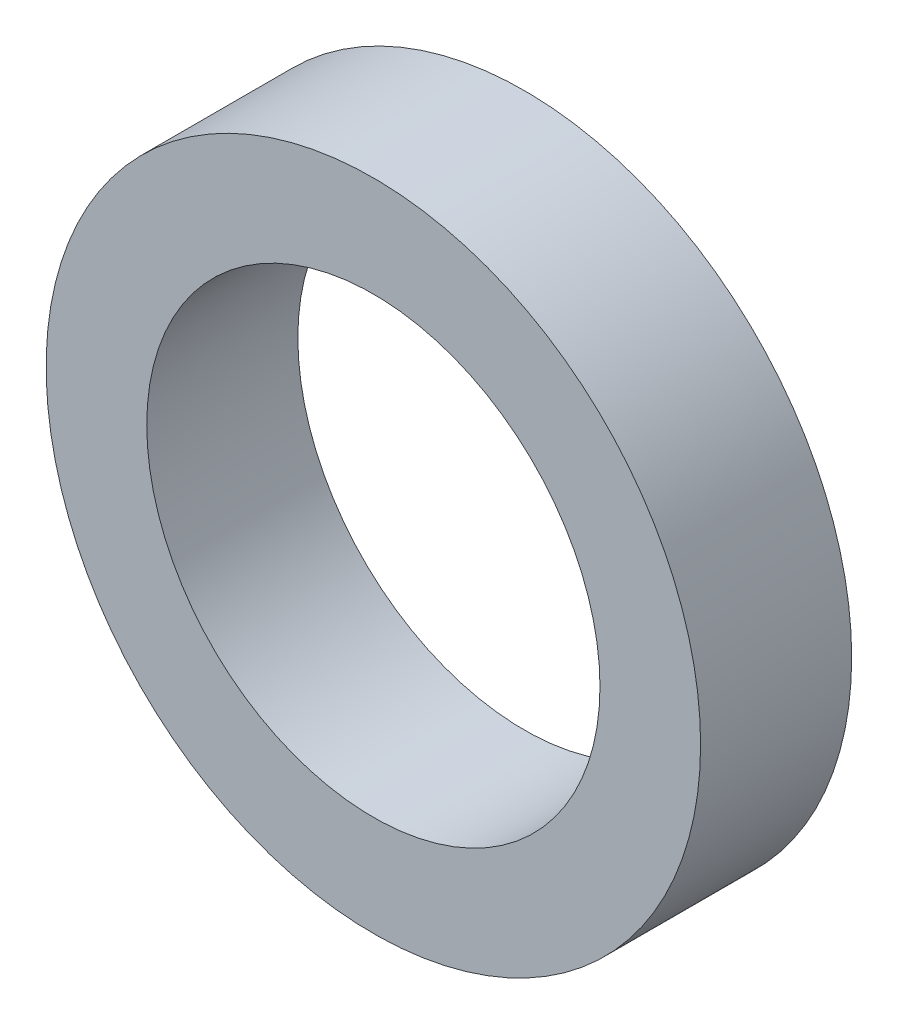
from build123d import *

# Parameters (mm, degrees)
SKETCH1_R           = 82.5246
BOSS_EXTRUDE1_DEPTH = 38.1
SKETCH2_R           = 57.15
CUT_EXTRUDE1_DEPTH  = 123.769007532


with BuildPart() as part:
    # Sketch1 → Boss-Extrude1 (new body)
    with BuildSketch(Plane.XY):
        Circle(SKETCH1_R)
    extrude(amount=BOSS_EXTRUDE1_DEPTH)

    # Sketch2 → Cut-Extrude1 (cut, through all)
    with BuildSketch(Plane.XY):
        Circle(SKETCH2_R)
    extrude(amount=CUT_EXTRUDE1_DEPTH, mode=Mode.SUBTRACT)


solid = part.part
